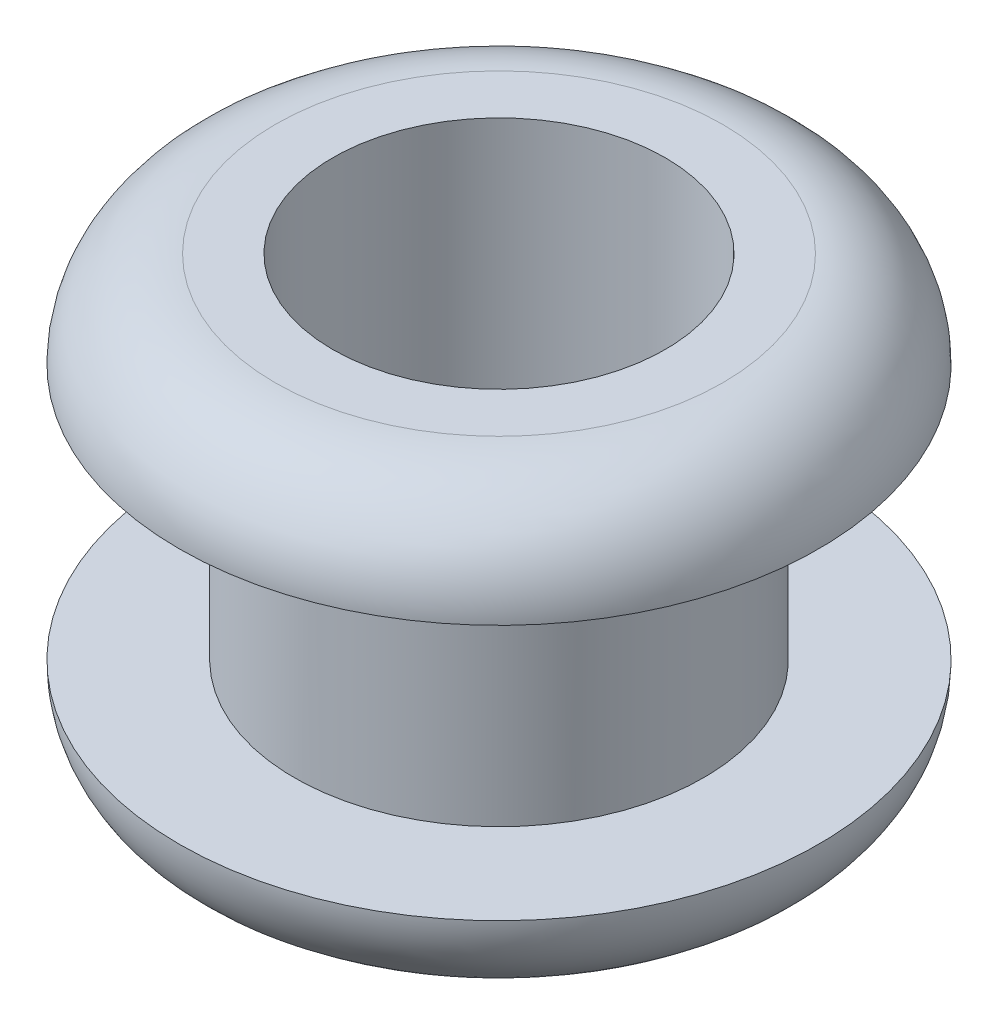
ISO-10303-21;
HEADER;
FILE_DESCRIPTION(('STEP AP214'),'2;1');
FILE_NAME('part.step','',(''),(''),'','','');
FILE_SCHEMA(('AUTOMOTIVE_DESIGN { 1 0 10303 214 1 1 1 1 }'));
ENDSEC;
DATA;
#1=APPLICATION_CONTEXT('core data for automotive mechanical design processes');
#2=APPLICATION_PROTOCOL_DEFINITION('international standard','automotive_design',2000,#1);
#3=PRODUCT_CONTEXT('',#1,'mechanical');
#4=PRODUCT('Part','Part','',(#3));
#5=PRODUCT_RELATED_PRODUCT_CATEGORY('part','',(#4));
#6=PRODUCT_DEFINITION_FORMATION('','',#4);
#7=PRODUCT_DEFINITION_CONTEXT('part definition',#1,'design');
#8=PRODUCT_DEFINITION('design','',#6,#7);
#9=PRODUCT_DEFINITION_SHAPE('','',#8);
#10=(LENGTH_UNIT() NAMED_UNIT(*) SI_UNIT(.MILLI.,.METRE.));
#11=(NAMED_UNIT(*) PLANE_ANGLE_UNIT() SI_UNIT($,.RADIAN.));
#12=(NAMED_UNIT(*) SI_UNIT($,.STERADIAN.) SOLID_ANGLE_UNIT());
#13=UNCERTAINTY_MEASURE_WITH_UNIT(LENGTH_MEASURE(1.E-05),#10,'distance_accuracy_value','');
#14=(GEOMETRIC_REPRESENTATION_CONTEXT(3) GLOBAL_UNCERTAINTY_ASSIGNED_CONTEXT((#13)) GLOBAL_UNIT_ASSIGNED_CONTEXT((#10,
#11,#12)) REPRESENTATION_CONTEXT('',''));
#15=CARTESIAN_POINT('',(0.,0.,0.));
#16=DIRECTION('',(0.,0.,1.));
#17=DIRECTION('',(1.,0.,0.));
#18=AXIS2_PLACEMENT_3D('',#15,#16,#17);
#19=CARTESIAN_POINT('',(0.,2.,0.));
#20=DIRECTION('',(0.,-1.,0.));
#21=DIRECTION('',(0.,0.,-1.));
#22=AXIS2_PLACEMENT_3D('',#19,#20,#21);
#23=CYLINDRICAL_SURFACE('',#22,1.6);
#24=CARTESIAN_POINT('',(0.,2.,0.));
#25=DIRECTION('',(0.,1.,0.));
#26=DIRECTION('',(0.,0.,1.));
#27=AXIS2_PLACEMENT_3D('',#24,#25,#26);
#28=CIRCLE('',#27,1.6);
#29=CARTESIAN_POINT('',(0.,2.,1.6));
#30=VERTEX_POINT('',#29);
#31=EDGE_CURVE('E38',#30,#30,#28,.T.);
#32=ORIENTED_EDGE('',*,*,#31,.F.);
#33=EDGE_LOOP('',(#32));
#34=FACE_BOUND('',#33,.T.);
#35=CARTESIAN_POINT('',(0.,0.,0.));
#36=DIRECTION('',(0.,-1.,0.));
#37=DIRECTION('',(0.,0.,-1.));
#38=AXIS2_PLACEMENT_3D('',#35,#36,#37);
#39=CIRCLE('',#38,1.6);
#40=CARTESIAN_POINT('',(0.,0.,-1.6));
#41=VERTEX_POINT('',#40);
#42=EDGE_CURVE('E47',#41,#41,#39,.T.);
#43=ORIENTED_EDGE('',*,*,#42,.F.);
#44=EDGE_LOOP('',(#43));
#45=FACE_BOUND('',#44,.T.);
#46=ADVANCED_FACE('F28',(#34,#45),#23,.T.);
#47=CARTESIAN_POINT('',(0.,2.,0.));
#48=DIRECTION('',(0.,1.,0.));
#49=DIRECTION('',(0.,0.,1.));
#50=AXIS2_PLACEMENT_3D('',#47,#48,#49);
#51=PLANE('',#50);
#52=CARTESIAN_POINT('',(0.,2.,0.));
#53=DIRECTION('',(0.,1.,0.));
#54=DIRECTION('',(0.,0.,1.));
#55=AXIS2_PLACEMENT_3D('',#52,#53,#54);
#56=CIRCLE('',#55,2.5);
#57=CARTESIAN_POINT('',(0.,2.,2.5));
#58=VERTEX_POINT('',#57);
#59=EDGE_CURVE('E42',#58,#58,#56,.T.);
#60=ORIENTED_EDGE('',*,*,#59,.F.);
#61=EDGE_LOOP('',(#60));
#62=FACE_BOUND('',#61,.T.);
#63=ORIENTED_EDGE('',*,*,#31,.T.);
#64=EDGE_LOOP('',(#63));
#65=FACE_BOUND('',#64,.T.);
#66=ADVANCED_FACE('F77',(#62,#65),#51,.F.);
#67=CARTESIAN_POINT('',(0.,2.75,0.));
#68=DIRECTION('',(0.,1.,0.));
#69=DIRECTION('',(0.,0.,1.));
#70=AXIS2_PLACEMENT_3D('',#67,#68,#69);
#71=PLANE('',#70);
#72=CARTESIAN_POINT('',(0.,2.75,0.));
#73=DIRECTION('',(0.,1.,0.));
#74=DIRECTION('',(0.,0.,1.));
#75=AXIS2_PLACEMENT_3D('',#72,#73,#74);
#76=CIRCLE('',#75,1.75);
#77=CARTESIAN_POINT('',(0.,2.75,1.75));
#78=VERTEX_POINT('',#77);
#79=EDGE_CURVE('E10',#78,#78,#76,.T.);
#80=ORIENTED_EDGE('',*,*,#79,.T.);
#81=EDGE_LOOP('',(#80));
#82=FACE_BOUND('',#81,.T.);
#83=CARTESIAN_POINT('',(0.,2.75,0.));
#84=DIRECTION('',(0.,-1.,0.));
#85=DIRECTION('',(0.,0.,-1.));
#86=AXIS2_PLACEMENT_3D('',#83,#84,#85);
#87=CIRCLE('',#86,1.3);
#88=CARTESIAN_POINT('',(0.,2.75,-1.3));
#89=VERTEX_POINT('',#88);
#90=EDGE_CURVE('E53',#89,#89,#87,.T.);
#91=ORIENTED_EDGE('',*,*,#90,.T.);
#92=EDGE_LOOP('',(#91));
#93=FACE_BOUND('',#92,.T.);
#94=ADVANCED_FACE('F72',(#82,#93),#71,.T.);
#95=CARTESIAN_POINT('',(0.,0.,0.));
#96=DIRECTION('',(0.,-1.,0.));
#97=DIRECTION('',(0.,0.,-1.));
#98=AXIS2_PLACEMENT_3D('',#95,#96,#97);
#99=PLANE('',#98);
#100=CARTESIAN_POINT('',(0.,0.,0.));
#101=DIRECTION('',(0.,-1.,0.));
#102=DIRECTION('',(0.,0.,-1.));
#103=AXIS2_PLACEMENT_3D('',#100,#101,#102);
#104=CIRCLE('',#103,2.5);
#105=CARTESIAN_POINT('',(0.,0.,-2.5));
#106=VERTEX_POINT('',#105);
#107=EDGE_CURVE('E50',#106,#106,#104,.T.);
#108=ORIENTED_EDGE('',*,*,#107,.F.);
#109=EDGE_LOOP('',(#108));
#110=FACE_BOUND('',#109,.T.);
#111=ORIENTED_EDGE('',*,*,#42,.T.);
#112=EDGE_LOOP('',(#111));
#113=FACE_BOUND('',#112,.T.);
#114=ADVANCED_FACE('F64',(#110,#113),#99,.F.);
#115=CARTESIAN_POINT('',(0.,-0.75,0.));
#116=DIRECTION('',(0.,-1.,0.));
#117=DIRECTION('',(0.,0.,-1.));
#118=AXIS2_PLACEMENT_3D('',#115,#116,#117);
#119=PLANE('',#118);
#120=CARTESIAN_POINT('',(0.,-0.75,0.));
#121=DIRECTION('',(0.,-1.,0.));
#122=DIRECTION('',(0.,0.,-1.));
#123=AXIS2_PLACEMENT_3D('',#120,#121,#122);
#124=CIRCLE('',#123,1.75);
#125=CARTESIAN_POINT('',(0.,-0.75,-1.75));
#126=VERTEX_POINT('',#125);
#127=EDGE_CURVE('E34',#126,#126,#124,.T.);
#128=ORIENTED_EDGE('',*,*,#127,.T.);
#129=EDGE_LOOP('',(#128));
#130=FACE_BOUND('',#129,.T.);
#131=CARTESIAN_POINT('',(0.,-0.75,0.));
#132=DIRECTION('',(0.,-1.,0.));
#133=DIRECTION('',(0.,0.,-1.));
#134=AXIS2_PLACEMENT_3D('',#131,#132,#133);
#135=CIRCLE('',#134,1.3);
#136=CARTESIAN_POINT('',(0.,-0.75,-1.3));
#137=VERTEX_POINT('',#136);
#138=EDGE_CURVE('E56',#137,#137,#135,.T.);
#139=ORIENTED_EDGE('',*,*,#138,.F.);
#140=EDGE_LOOP('',(#139));
#141=FACE_BOUND('',#140,.T.);
#142=ADVANCED_FACE('F62',(#130,#141),#119,.T.);
#143=CARTESIAN_POINT('',(0.,2.,0.));
#144=DIRECTION('',(0.,-1.,0.));
#145=DIRECTION('',(0.,0.,-1.));
#146=AXIS2_PLACEMENT_3D('',#143,#144,#145);
#147=CYLINDRICAL_SURFACE('',#146,1.3);
#148=ORIENTED_EDGE('',*,*,#90,.F.);
#149=EDGE_LOOP('',(#148));
#150=FACE_BOUND('',#149,.T.);
#151=ORIENTED_EDGE('',*,*,#138,.T.);
#152=EDGE_LOOP('',(#151));
#153=FACE_BOUND('',#152,.T.);
#154=ADVANCED_FACE('F60',(#150,#153),#147,.F.);
#155=CARTESIAN_POINT('',(0.,0.,0.));
#156=DIRECTION('',(0.,-1.,0.));
#157=DIRECTION('',(0.,0.,-1.));
#158=AXIS2_PLACEMENT_3D('',#155,#156,#157);
#159=TOROIDAL_SURFACE('',#158,1.75,0.75);
#160=ORIENTED_EDGE('',*,*,#107,.T.);
#161=EDGE_LOOP('',(#160));
#162=FACE_BOUND('',#161,.T.);
#163=ORIENTED_EDGE('',*,*,#127,.F.);
#164=EDGE_LOOP('',(#163));
#165=FACE_BOUND('',#164,.T.);
#166=ADVANCED_FACE('F70',(#162,#165),#159,.T.);
#167=CARTESIAN_POINT('',(0.,2.,0.));
#168=DIRECTION('',(0.,1.,0.));
#169=DIRECTION('',(0.,0.,1.));
#170=AXIS2_PLACEMENT_3D('',#167,#168,#169);
#171=TOROIDAL_SURFACE('',#170,1.75,0.75);
#172=ORIENTED_EDGE('',*,*,#59,.T.);
#173=EDGE_LOOP('',(#172));
#174=FACE_BOUND('',#173,.T.);
#175=ORIENTED_EDGE('',*,*,#79,.F.);
#176=EDGE_LOOP('',(#175));
#177=FACE_BOUND('',#176,.T.);
#178=ADVANCED_FACE('F94',(#174,#177),#171,.T.);
#179=CLOSED_SHELL('',(#46,#66,#94,#114,#142,#154,#166,#178));
#180=MANIFOLD_SOLID_BREP('B2',#179);
#181=ADVANCED_BREP_SHAPE_REPRESENTATION('',(#18,#180),#14);
#182=SHAPE_DEFINITION_REPRESENTATION(#9,#181);
ENDSEC;
END-ISO-10303-21;
